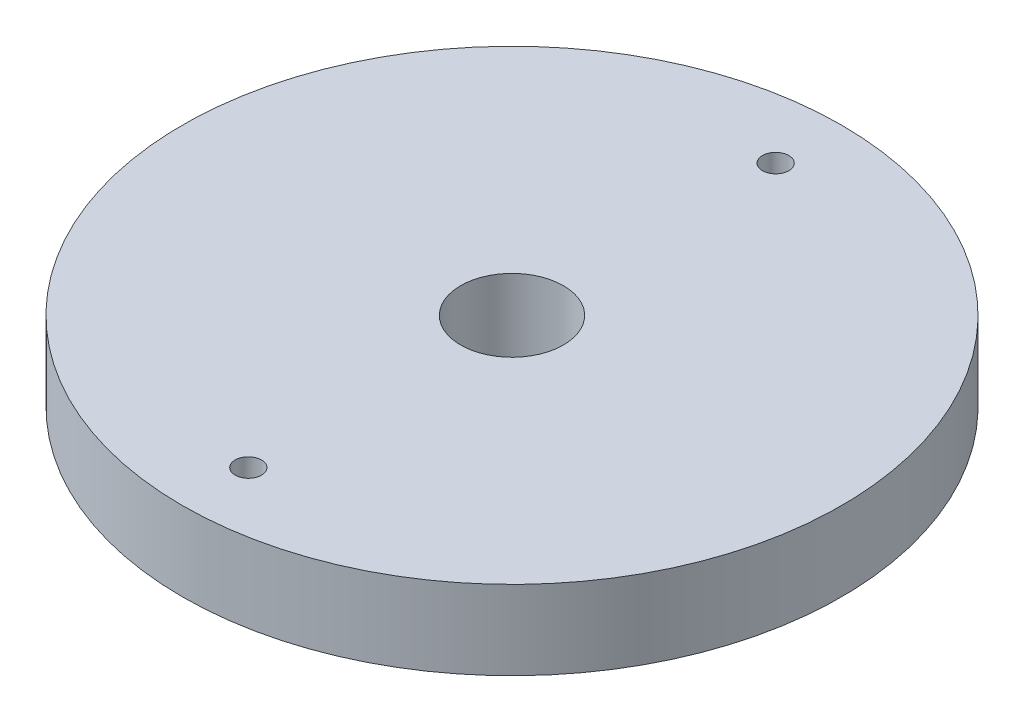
ISO-10303-21;
HEADER;
FILE_DESCRIPTION(('STEP AP214'),'2;1');
FILE_NAME('part.step','',(''),(''),'','','');
FILE_SCHEMA(('AUTOMOTIVE_DESIGN { 1 0 10303 214 1 1 1 1 }'));
ENDSEC;
DATA;
#1=APPLICATION_CONTEXT('core data for automotive mechanical design processes');
#2=APPLICATION_PROTOCOL_DEFINITION('international standard','automotive_design',2000,#1);
#3=PRODUCT_CONTEXT('',#1,'mechanical');
#4=PRODUCT('Part','Part','',(#3));
#5=PRODUCT_RELATED_PRODUCT_CATEGORY('part','',(#4));
#6=PRODUCT_DEFINITION_FORMATION('','',#4);
#7=PRODUCT_DEFINITION_CONTEXT('part definition',#1,'design');
#8=PRODUCT_DEFINITION('design','',#6,#7);
#9=PRODUCT_DEFINITION_SHAPE('','',#8);
#10=(LENGTH_UNIT() NAMED_UNIT(*) SI_UNIT(.MILLI.,.METRE.));
#11=(NAMED_UNIT(*) PLANE_ANGLE_UNIT() SI_UNIT($,.RADIAN.));
#12=(NAMED_UNIT(*) SI_UNIT($,.STERADIAN.) SOLID_ANGLE_UNIT());
#13=UNCERTAINTY_MEASURE_WITH_UNIT(LENGTH_MEASURE(1.E-05),#10,'distance_accuracy_value','');
#14=(GEOMETRIC_REPRESENTATION_CONTEXT(3) GLOBAL_UNCERTAINTY_ASSIGNED_CONTEXT((#13)) GLOBAL_UNIT_ASSIGNED_CONTEXT((#10,
#11,#12)) REPRESENTATION_CONTEXT('',''));
#15=CARTESIAN_POINT('',(0.,0.,0.));
#16=DIRECTION('',(0.,0.,1.));
#17=DIRECTION('',(1.,0.,0.));
#18=AXIS2_PLACEMENT_3D('',#15,#16,#17);
#19=CARTESIAN_POINT('',(0.,3.,0.));
#20=DIRECTION('',(0.,1.,0.));
#21=DIRECTION('',(0.,0.,1.));
#22=AXIS2_PLACEMENT_3D('',#19,#20,#21);
#23=PLANE('',#22);
#24=CARTESIAN_POINT('',(0.,3.,-10.));
#25=DIRECTION('',(0.,1.,0.));
#26=DIRECTION('',(0.,0.,1.));
#27=AXIS2_PLACEMENT_3D('',#24,#25,#26);
#28=CIRCLE('',#27,0.5);
#29=CARTESIAN_POINT('',(0.,3.,-9.5));
#30=VERTEX_POINT('',#29);
#31=EDGE_CURVE('E49',#30,#30,#28,.T.);
#32=ORIENTED_EDGE('',*,*,#31,.F.);
#33=EDGE_LOOP('',(#32));
#34=FACE_BOUND('',#33,.T.);
#35=CARTESIAN_POINT('',(0.,3.,0.));
#36=DIRECTION('',(0.,1.,0.));
#37=DIRECTION('',(0.,0.,1.));
#38=AXIS2_PLACEMENT_3D('',#35,#36,#37);
#39=CIRCLE('',#38,12.5);
#40=CARTESIAN_POINT('',(0.,3.,12.5));
#41=VERTEX_POINT('',#40);
#42=EDGE_CURVE('E10',#41,#41,#39,.T.);
#43=ORIENTED_EDGE('',*,*,#42,.T.);
#44=EDGE_LOOP('',(#43));
#45=FACE_BOUND('',#44,.T.);
#46=CARTESIAN_POINT('',(0.,3.,0.));
#47=DIRECTION('',(0.,1.,0.));
#48=DIRECTION('',(0.,0.,1.));
#49=AXIS2_PLACEMENT_3D('',#46,#47,#48);
#50=CIRCLE('',#49,1.95);
#51=CARTESIAN_POINT('',(0.,3.,-1.95));
#52=VERTEX_POINT('',#51);
#53=EDGE_CURVE('E42',#52,#52,#50,.T.);
#54=ORIENTED_EDGE('',*,*,#53,.F.);
#55=EDGE_LOOP('',(#54));
#56=FACE_BOUND('',#55,.T.);
#57=CARTESIAN_POINT('',(0.,3.,10.));
#58=DIRECTION('',(0.,1.,0.));
#59=DIRECTION('',(0.,0.,1.));
#60=AXIS2_PLACEMENT_3D('',#57,#58,#59);
#61=CIRCLE('',#60,0.5);
#62=CARTESIAN_POINT('',(0.,3.,10.5));
#63=VERTEX_POINT('',#62);
#64=EDGE_CURVE('E55',#63,#63,#61,.T.);
#65=ORIENTED_EDGE('',*,*,#64,.F.);
#66=EDGE_LOOP('',(#65));
#67=FACE_BOUND('',#66,.T.);
#68=ADVANCED_FACE('F31',(#34,#45,#56,#67),#23,.T.);
#69=CARTESIAN_POINT('',(0.,0.,0.));
#70=DIRECTION('',(0.,1.,0.));
#71=DIRECTION('',(0.,0.,1.));
#72=AXIS2_PLACEMENT_3D('',#69,#70,#71);
#73=PLANE('',#72);
#74=CARTESIAN_POINT('',(0.,0.,-10.));
#75=DIRECTION('',(0.,1.,0.));
#76=DIRECTION('',(0.,0.,1.));
#77=AXIS2_PLACEMENT_3D('',#74,#75,#76);
#78=CIRCLE('',#77,0.5);
#79=CARTESIAN_POINT('',(0.,0.,-9.5));
#80=VERTEX_POINT('',#79);
#81=EDGE_CURVE('E52',#80,#80,#78,.T.);
#82=ORIENTED_EDGE('',*,*,#81,.T.);
#83=EDGE_LOOP('',(#82));
#84=FACE_BOUND('',#83,.T.);
#85=CARTESIAN_POINT('',(0.,0.,0.));
#86=DIRECTION('',(0.,1.,0.));
#87=DIRECTION('',(0.,0.,1.));
#88=AXIS2_PLACEMENT_3D('',#85,#86,#87);
#89=CIRCLE('',#88,12.5);
#90=CARTESIAN_POINT('',(0.,0.,12.5));
#91=VERTEX_POINT('',#90);
#92=EDGE_CURVE('E35',#91,#91,#89,.T.);
#93=ORIENTED_EDGE('',*,*,#92,.F.);
#94=EDGE_LOOP('',(#93));
#95=FACE_BOUND('',#94,.T.);
#96=CARTESIAN_POINT('',(0.,0.,0.));
#97=DIRECTION('',(0.,1.,0.));
#98=DIRECTION('',(0.,0.,1.));
#99=AXIS2_PLACEMENT_3D('',#96,#97,#98);
#100=CIRCLE('',#99,1.95);
#101=CARTESIAN_POINT('',(0.,0.,-1.95));
#102=VERTEX_POINT('',#101);
#103=EDGE_CURVE('E46',#102,#102,#100,.T.);
#104=ORIENTED_EDGE('',*,*,#103,.T.);
#105=EDGE_LOOP('',(#104));
#106=FACE_BOUND('',#105,.T.);
#107=CARTESIAN_POINT('',(0.,0.,10.));
#108=DIRECTION('',(0.,1.,0.));
#109=DIRECTION('',(0.,0.,-1.));
#110=AXIS2_PLACEMENT_3D('',#107,#108,#109);
#111=CIRCLE('',#110,0.5);
#112=CARTESIAN_POINT('',(0.,0.,9.5));
#113=VERTEX_POINT('',#112);
#114=EDGE_CURVE('E58',#113,#113,#111,.T.);
#115=ORIENTED_EDGE('',*,*,#114,.T.);
#116=EDGE_LOOP('',(#115));
#117=FACE_BOUND('',#116,.T.);
#118=ADVANCED_FACE('F62',(#84,#95,#106,#117),#73,.F.);
#119=CARTESIAN_POINT('',(0.,3.,0.));
#120=DIRECTION('',(0.,-1.,0.));
#121=DIRECTION('',(0.,0.,-1.));
#122=AXIS2_PLACEMENT_3D('',#119,#120,#121);
#123=CYLINDRICAL_SURFACE('',#122,12.5);
#124=ORIENTED_EDGE('',*,*,#42,.F.);
#125=EDGE_LOOP('',(#124));
#126=FACE_BOUND('',#125,.T.);
#127=ORIENTED_EDGE('',*,*,#92,.T.);
#128=EDGE_LOOP('',(#127));
#129=FACE_BOUND('',#128,.T.);
#130=ADVANCED_FACE('F33',(#126,#129),#123,.T.);
#131=CARTESIAN_POINT('',(0.,3.001,0.));
#132=DIRECTION('',(0.,-1.,0.));
#133=DIRECTION('',(0.,0.,-1.));
#134=AXIS2_PLACEMENT_3D('',#131,#132,#133);
#135=CYLINDRICAL_SURFACE('',#134,1.95);
#136=CARTESIAN_POINT('',(0.,3.,-1.95));
#137=CARTESIAN_POINT('',(0.,2.96875,-1.95));
#138=CARTESIAN_POINT('',(0.,2.9375,-1.95));
#139=CARTESIAN_POINT('',(0.,2.875,-1.95));
#140=CARTESIAN_POINT('',(0.,2.84375,-1.95));
#141=CARTESIAN_POINT('',(0.,2.78125,-1.95));
#142=CARTESIAN_POINT('',(0.,2.75,-1.95));
#143=CARTESIAN_POINT('',(0.,2.6875,-1.95));
#144=CARTESIAN_POINT('',(0.,2.65625,-1.95));
#145=CARTESIAN_POINT('',(0.,2.59375,-1.95));
#146=CARTESIAN_POINT('',(0.,2.5625,-1.95));
#147=CARTESIAN_POINT('',(0.,2.5,-1.95));
#148=CARTESIAN_POINT('',(0.,2.46875,-1.95));
#149=CARTESIAN_POINT('',(0.,2.40625,-1.95));
#150=CARTESIAN_POINT('',(0.,2.375,-1.95));
#151=CARTESIAN_POINT('',(0.,2.3125,-1.95));
#152=CARTESIAN_POINT('',(0.,2.28125,-1.95));
#153=CARTESIAN_POINT('',(0.,2.21875,-1.95));
#154=CARTESIAN_POINT('',(0.,2.1875,-1.95));
#155=CARTESIAN_POINT('',(0.,2.125,-1.95));
#156=CARTESIAN_POINT('',(0.,2.09375,-1.95));
#157=CARTESIAN_POINT('',(0.,2.03125,-1.95));
#158=CARTESIAN_POINT('',(0.,2.,-1.95));
#159=CARTESIAN_POINT('',(0.,1.9375,-1.95));
#160=CARTESIAN_POINT('',(0.,1.90625,-1.95));
#161=CARTESIAN_POINT('',(0.,1.84375,-1.95));
#162=CARTESIAN_POINT('',(0.,1.8125,-1.95));
#163=CARTESIAN_POINT('',(0.,1.75,-1.95));
#164=CARTESIAN_POINT('',(0.,1.71875,-1.95));
#165=CARTESIAN_POINT('',(0.,1.65625,-1.95));
#166=CARTESIAN_POINT('',(0.,1.625,-1.95));
#167=CARTESIAN_POINT('',(0.,1.5625,-1.95));
#168=CARTESIAN_POINT('',(0.,1.53125,-1.95));
#169=CARTESIAN_POINT('',(0.,1.46875,-1.95));
#170=CARTESIAN_POINT('',(0.,1.4375,-1.95));
#171=CARTESIAN_POINT('',(0.,1.375,-1.95));
#172=CARTESIAN_POINT('',(0.,1.34375,-1.95));
#173=CARTESIAN_POINT('',(0.,1.28125,-1.95));
#174=CARTESIAN_POINT('',(0.,1.25,-1.95));
#175=CARTESIAN_POINT('',(0.,1.1875,-1.95));
#176=CARTESIAN_POINT('',(0.,1.15625,-1.95));
#177=CARTESIAN_POINT('',(0.,1.09375,-1.95));
#178=CARTESIAN_POINT('',(0.,1.0625,-1.95));
#179=CARTESIAN_POINT('',(0.,1.,-1.95));
#180=CARTESIAN_POINT('',(0.,0.96875,-1.95));
#181=CARTESIAN_POINT('',(0.,0.90625,-1.95));
#182=CARTESIAN_POINT('',(0.,0.875,-1.95));
#183=CARTESIAN_POINT('',(0.,0.8125,-1.95));
#184=CARTESIAN_POINT('',(0.,0.78125,-1.95));
#185=CARTESIAN_POINT('',(0.,0.71875,-1.95));
#186=CARTESIAN_POINT('',(0.,0.6875,-1.95));
#187=CARTESIAN_POINT('',(0.,0.625,-1.95));
#188=CARTESIAN_POINT('',(0.,0.59375,-1.95));
#189=CARTESIAN_POINT('',(0.,0.53125,-1.95));
#190=CARTESIAN_POINT('',(0.,0.5,-1.95));
#191=CARTESIAN_POINT('',(0.,0.4375,-1.95));
#192=CARTESIAN_POINT('',(0.,0.40625,-1.95));
#193=CARTESIAN_POINT('',(0.,0.34375,-1.95));
#194=CARTESIAN_POINT('',(0.,0.3125,-1.95));
#195=CARTESIAN_POINT('',(0.,0.25,-1.95));
#196=CARTESIAN_POINT('',(0.,0.21875,-1.95));
#197=CARTESIAN_POINT('',(0.,0.15625,-1.95));
#198=CARTESIAN_POINT('',(0.,0.125,-1.95));
#199=CARTESIAN_POINT('',(0.,0.0624999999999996,-1.95));
#200=CARTESIAN_POINT('',(0.,0.0312499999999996,-1.95));
#201=CARTESIAN_POINT('',(0.,0.,-1.95));
#202=B_SPLINE_CURVE_WITH_KNOTS('',3,(#136,#137,#138,#139,#140,#141,#142,#143,#144,#145,#146,
#147,#148,#149,#150,#151,#152,#153,#154,#155,#156,#157,#158,#159,#160,#161,#162,#163,#164,#165,
#166,#167,#168,#169,#170,#171,#172,#173,#174,#175,#176,#177,#178,#179,#180,#181,#182,#183,#184,
#185,#186,#187,#188,#189,#190,#191,#192,#193,#194,#195,#196,#197,#198,#199,#200,#201),
.UNSPECIFIED.,.F.,.F.,(4,2,2,2,2,2,2,2,2,2,2,2,2,2,2,2,2,2,2,2,2,2,2,2,2,2,2,2,2,2,2,2,4),(0.,
0.0937499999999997,0.1875,0.28125,0.375,0.46875,0.5625,0.65625,0.75,0.84375,0.9375,1.03125,
1.125,1.21875,1.3125,1.40625,1.5,1.59375,1.6875,1.78125,1.875,1.96875,2.0625,2.15625,2.25,
2.34375,2.4375,2.53125,2.625,2.71875,2.8125,2.90625,3.),.UNSPECIFIED.);
#203=EDGE_CURVE('BSEAM72',#52,#102,#202,.T.);
#204=ORIENTED_EDGE('',*,*,#53,.T.);
#205=ORIENTED_EDGE('',*,*,#103,.F.);
#206=ORIENTED_EDGE('',*,*,#203,.T.);
#207=ORIENTED_EDGE('',*,*,#203,.F.);
#208=EDGE_LOOP('',(#204,#206,#205,#207));
#209=FACE_BOUND('',#208,.T.);
#210=ADVANCED_FACE('F72',(#209),#135,.F.);
#211=CARTESIAN_POINT('',(0.,3.001,-10.));
#212=DIRECTION('',(0.,-1.,0.));
#213=DIRECTION('',(0.,0.,-1.));
#214=AXIS2_PLACEMENT_3D('',#211,#212,#213);
#215=CYLINDRICAL_SURFACE('',#214,0.5);
#216=ORIENTED_EDGE('',*,*,#31,.T.);
#217=EDGE_LOOP('',(#216));
#218=FACE_BOUND('',#217,.T.);
#219=ORIENTED_EDGE('',*,*,#81,.F.);
#220=EDGE_LOOP('',(#219));
#221=FACE_BOUND('',#220,.T.);
#222=ADVANCED_FACE('F66',(#218,#221),#215,.F.);
#223=CARTESIAN_POINT('',(0.,3.001,10.));
#224=DIRECTION('',(0.,-1.,0.));
#225=DIRECTION('',(0.,0.,-1.));
#226=AXIS2_PLACEMENT_3D('',#223,#224,#225);
#227=CYLINDRICAL_SURFACE('',#226,0.5);
#228=ORIENTED_EDGE('',*,*,#64,.T.);
#229=EDGE_LOOP('',(#228));
#230=FACE_BOUND('',#229,.T.);
#231=ORIENTED_EDGE('',*,*,#114,.F.);
#232=EDGE_LOOP('',(#231));
#233=FACE_BOUND('',#232,.T.);
#234=ADVANCED_FACE('F64',(#230,#233),#227,.F.);
#235=CLOSED_SHELL('',(#68,#118,#130,#210,#222,#234));
#236=MANIFOLD_SOLID_BREP('B2',#235);
#237=ADVANCED_BREP_SHAPE_REPRESENTATION('',(#18,#236),#14);
#238=SHAPE_DEFINITION_REPRESENTATION(#9,#237);
ENDSEC;
END-ISO-10303-21;
